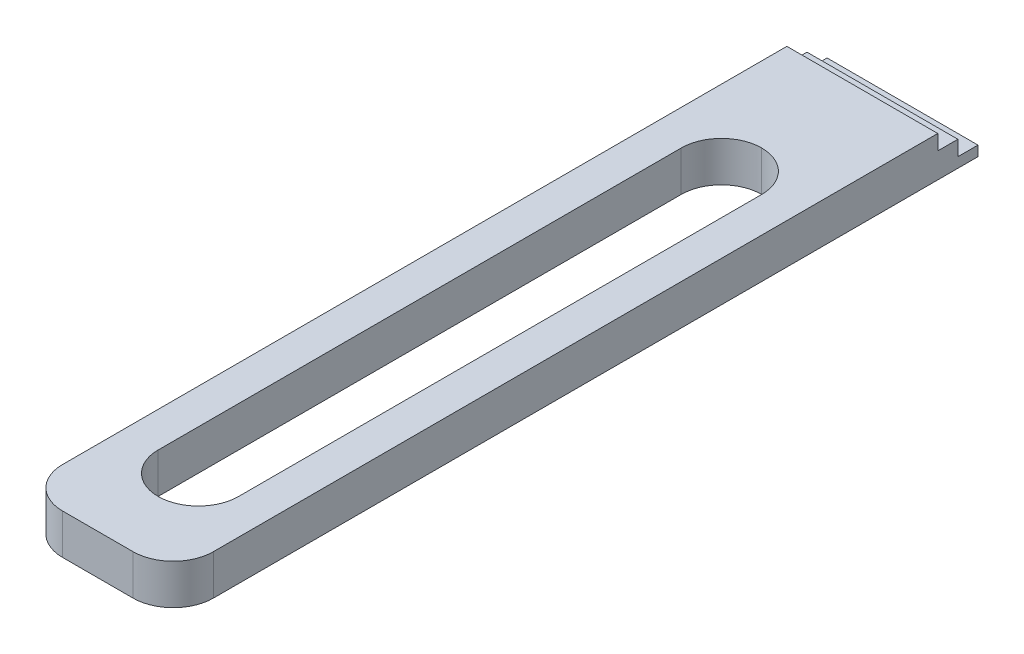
ISO-10303-21;
HEADER;
FILE_DESCRIPTION(('STEP AP214'),'2;1');
FILE_NAME('part.step','',(''),(''),'','','');
FILE_SCHEMA(('AUTOMOTIVE_DESIGN { 1 0 10303 214 1 1 1 1 }'));
ENDSEC;
DATA;
#1=APPLICATION_CONTEXT('core data for automotive mechanical design processes');
#2=APPLICATION_PROTOCOL_DEFINITION('international standard','automotive_design',2000,#1);
#3=PRODUCT_CONTEXT('',#1,'mechanical');
#4=PRODUCT('Part','Part','',(#3));
#5=PRODUCT_RELATED_PRODUCT_CATEGORY('part','',(#4));
#6=PRODUCT_DEFINITION_FORMATION('','',#4);
#7=PRODUCT_DEFINITION_CONTEXT('part definition',#1,'design');
#8=PRODUCT_DEFINITION('design','',#6,#7);
#9=PRODUCT_DEFINITION_SHAPE('','',#8);
#10=(LENGTH_UNIT() NAMED_UNIT(*) SI_UNIT(.MILLI.,.METRE.));
#11=(NAMED_UNIT(*) PLANE_ANGLE_UNIT() SI_UNIT($,.RADIAN.));
#12=(NAMED_UNIT(*) SI_UNIT($,.STERADIAN.) SOLID_ANGLE_UNIT());
#13=UNCERTAINTY_MEASURE_WITH_UNIT(LENGTH_MEASURE(1.E-05),#10,'distance_accuracy_value','');
#14=(GEOMETRIC_REPRESENTATION_CONTEXT(3) GLOBAL_UNCERTAINTY_ASSIGNED_CONTEXT((#13)) GLOBAL_UNIT_ASSIGNED_CONTEXT((#10,
#11,#12)) REPRESENTATION_CONTEXT('',''));
#15=CARTESIAN_POINT('',(0.,0.,0.));
#16=DIRECTION('',(0.,0.,1.));
#17=DIRECTION('',(1.,0.,0.));
#18=AXIS2_PLACEMENT_3D('',#15,#16,#17);
#19=CARTESIAN_POINT('',(-15.4687168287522,4.,-48.7982833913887));
#20=DIRECTION('',(0.,0.,1.));
#21=DIRECTION('',(1.,0.,0.));
#22=AXIS2_PLACEMENT_3D('',#19,#20,#21);
#23=PLANE('',#22);
#24=DIRECTION('',(-1.,0.,0.));
#25=VECTOR('',#24,1.);
#26=CARTESIAN_POINT('',(-15.4687168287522,1.,-48.7982833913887));
#27=LINE('',#26,#25);
#28=CARTESIAN_POINT('',(-0.468716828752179,1.,-48.7982833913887));
#29=VERTEX_POINT('',#28);
#30=CARTESIAN_POINT('',(-15.4687168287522,1.,-48.7982833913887));
#31=VERTEX_POINT('',#30);
#32=EDGE_CURVE('E171',#29,#31,#27,.T.);
#33=ORIENTED_EDGE('',*,*,#32,.F.);
#34=DIRECTION('',(0.,-1.,0.));
#35=VECTOR('',#34,1.);
#36=CARTESIAN_POINT('',(-0.468716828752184,4.,-48.7982833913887));
#37=LINE('',#36,#35);
#38=CARTESIAN_POINT('',(-0.468716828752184,0.,-48.7982833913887));
#39=VERTEX_POINT('',#38);
#40=EDGE_CURVE('E577',#29,#39,#37,.T.);
#41=ORIENTED_EDGE('',*,*,#40,.T.);
#42=DIRECTION('',(-1.,0.,0.));
#43=VECTOR('',#42,1.);
#44=CARTESIAN_POINT('',(-15.4687168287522,0.,-48.7982833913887));
#45=LINE('',#44,#43);
#46=CARTESIAN_POINT('',(-15.4687168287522,0.,-48.7982833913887));
#47=VERTEX_POINT('',#46);
#48=EDGE_CURVE('E572',#39,#47,#45,.T.);
#49=ORIENTED_EDGE('',*,*,#48,.T.);
#50=DIRECTION('',(0.,-1.,0.));
#51=VECTOR('',#50,1.);
#52=CARTESIAN_POINT('',(-15.4687168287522,4.,-48.7982833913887));
#53=LINE('',#52,#51);
#54=EDGE_CURVE('E557',#31,#47,#53,.T.);
#55=ORIENTED_EDGE('',*,*,#54,.F.);
#56=EDGE_LOOP('',(#33,#41,#49,#55));
#57=FACE_BOUND('',#56,.T.);
#58=ADVANCED_FACE('F44',(#57),#23,.F.);
#59=CARTESIAN_POINT('',(0.,4.,0.));
#60=DIRECTION('',(0.,1.,0.));
#61=DIRECTION('',(0.,0.,1.));
#62=AXIS2_PLACEMENT_3D('',#59,#60,#61);
#63=PLANE('',#62);
#64=DIRECTION('',(1.,0.,0.));
#65=VECTOR('',#64,1.);
#66=CARTESIAN_POINT('',(-15.4687168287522,4.,-44.7982833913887));
#67=LINE('',#66,#65);
#68=CARTESIAN_POINT('',(-15.4687168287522,4.,-44.7982833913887));
#69=VERTEX_POINT('',#68);
#70=CARTESIAN_POINT('',(-0.468716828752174,4.,-44.7982833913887));
#71=VERTEX_POINT('',#70);
#72=EDGE_CURVE('E181',#69,#71,#67,.T.);
#73=ORIENTED_EDGE('',*,*,#72,.F.);
#74=DIRECTION('',(0.,0.,1.));
#75=VECTOR('',#74,1.);
#76=CARTESIAN_POINT('',(-15.4687168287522,4.,-48.7982833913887));
#77=LINE('',#76,#75);
#78=CARTESIAN_POINT('',(-15.4687168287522,4.,27.2017166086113));
#79=VERTEX_POINT('',#78);
#80=EDGE_CURVE('E575',#69,#79,#77,.T.);
#81=ORIENTED_EDGE('',*,*,#80,.T.);
#82=CARTESIAN_POINT('',(-11.4687168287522,4.,27.2017166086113));
#83=DIRECTION('',(0.,1.,0.));
#84=DIRECTION('',(0.,0.,1.));
#85=AXIS2_PLACEMENT_3D('',#82,#83,#84);
#86=CIRCLE('',#85,4.);
#87=CARTESIAN_POINT('',(-11.4687168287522,4.,31.2017166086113));
#88=VERTEX_POINT('',#87);
#89=EDGE_CURVE('E591',#79,#88,#86,.T.);
#90=ORIENTED_EDGE('',*,*,#89,.T.);
#91=DIRECTION('',(1.,0.,0.));
#92=VECTOR('',#91,1.);
#93=CARTESIAN_POINT('',(-15.4687168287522,4.,31.2017166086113));
#94=LINE('',#93,#92);
#95=CARTESIAN_POINT('',(-4.46871682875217,4.,31.2017166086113));
#96=VERTEX_POINT('',#95);
#97=EDGE_CURVE('E558',#88,#96,#94,.T.);
#98=ORIENTED_EDGE('',*,*,#97,.T.);
#99=CARTESIAN_POINT('',(-4.46871682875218,4.,27.2017166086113));
#100=DIRECTION('',(0.,1.,0.));
#101=DIRECTION('',(0.,0.,1.));
#102=AXIS2_PLACEMENT_3D('',#99,#100,#101);
#103=CIRCLE('',#102,4.);
#104=CARTESIAN_POINT('',(-0.468716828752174,4.,27.2017166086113));
#105=VERTEX_POINT('',#104);
#106=EDGE_CURVE('E593',#96,#105,#103,.T.);
#107=ORIENTED_EDGE('',*,*,#106,.T.);
#108=DIRECTION('',(0.,0.,-1.));
#109=VECTOR('',#108,1.);
#110=CARTESIAN_POINT('',(-0.468716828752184,4.,-48.7982833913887));
#111=LINE('',#110,#109);
#112=EDGE_CURVE('E552',#105,#71,#111,.T.);
#113=ORIENTED_EDGE('',*,*,#112,.T.);
#114=EDGE_LOOP('',(#73,#81,#90,#98,#107,#113));
#115=FACE_BOUND('',#114,.T.);
#116=CARTESIAN_POINT('',(-7.96871682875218,4.,21.2017166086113));
#117=DIRECTION('',(0.,1.,0.));
#118=DIRECTION('',(0.,0.,1.));
#119=AXIS2_PLACEMENT_3D('',#116,#117,#118);
#120=CIRCLE('',#119,4.);
#121=CARTESIAN_POINT('',(-3.96871682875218,4.,21.2017166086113));
#122=VERTEX_POINT('',#121);
#123=CARTESIAN_POINT('',(-7.96871682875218,4.,25.2017166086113));
#124=VERTEX_POINT('',#123);
#125=EDGE_CURVE('E626',#122,#124,#120,.F.);
#126=ORIENTED_EDGE('',*,*,#125,.T.);
#127=CARTESIAN_POINT('',(-7.96871682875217,4.,21.2017166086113));
#128=DIRECTION('',(0.,1.,0.));
#129=DIRECTION('',(0.,0.,1.));
#130=AXIS2_PLACEMENT_3D('',#127,#128,#129);
#131=CIRCLE('',#130,4.);
#132=CARTESIAN_POINT('',(-11.9687168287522,4.,21.2017166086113));
#133=VERTEX_POINT('',#132);
#134=EDGE_CURVE('E622',#124,#133,#131,.F.);
#135=ORIENTED_EDGE('',*,*,#134,.T.);
#136=DIRECTION('',(0.,0.,1.));
#137=VECTOR('',#136,1.);
#138=CARTESIAN_POINT('',(-11.9687168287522,4.,-34.7982833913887));
#139=LINE('',#138,#137);
#140=CARTESIAN_POINT('',(-11.9687168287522,4.,-30.7982833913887));
#141=VERTEX_POINT('',#140);
#142=EDGE_CURVE('E539',#141,#133,#139,.T.);
#143=ORIENTED_EDGE('',*,*,#142,.F.);
#144=CARTESIAN_POINT('',(-7.96871682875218,4.,-30.7982833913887));
#145=DIRECTION('',(0.,1.,0.));
#146=DIRECTION('',(0.,0.,1.));
#147=AXIS2_PLACEMENT_3D('',#144,#145,#146);
#148=CIRCLE('',#147,4.);
#149=CARTESIAN_POINT('',(-7.96871682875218,4.,-34.7982833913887));
#150=VERTEX_POINT('',#149);
#151=EDGE_CURVE('E12',#141,#150,#148,.F.);
#152=ORIENTED_EDGE('',*,*,#151,.T.);
#153=CARTESIAN_POINT('',(-7.96871682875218,4.,-30.7982833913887));
#154=DIRECTION('',(0.,1.,0.));
#155=DIRECTION('',(0.,0.,1.));
#156=AXIS2_PLACEMENT_3D('',#153,#154,#155);
#157=CIRCLE('',#156,4.);
#158=CARTESIAN_POINT('',(-3.96871682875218,4.,-30.7982833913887));
#159=VERTEX_POINT('',#158);
#160=EDGE_CURVE('E617',#150,#159,#157,.F.);
#161=ORIENTED_EDGE('',*,*,#160,.T.);
#162=DIRECTION('',(0.,0.,-1.));
#163=VECTOR('',#162,1.);
#164=CARTESIAN_POINT('',(-3.96871682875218,4.,-34.7982833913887));
#165=LINE('',#164,#163);
#166=EDGE_CURVE('E543',#122,#159,#165,.T.);
#167=ORIENTED_EDGE('',*,*,#166,.F.);
#168=EDGE_LOOP('',(#126,#135,#143,#152,#161,#167));
#169=FACE_BOUND('',#168,.T.);
#170=ADVANCED_FACE('F650',(#115,#169),#63,.T.);
#171=CARTESIAN_POINT('',(0.,0.,0.));
#172=DIRECTION('',(0.,1.,0.));
#173=DIRECTION('',(0.,0.,1.));
#174=AXIS2_PLACEMENT_3D('',#171,#172,#173);
#175=PLANE('',#174);
#176=DIRECTION('',(0.,0.,-1.));
#177=VECTOR('',#176,1.);
#178=CARTESIAN_POINT('',(-0.468716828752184,0.,-48.7982833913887));
#179=LINE('',#178,#177);
#180=CARTESIAN_POINT('',(-0.468716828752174,0.,27.2017166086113));
#181=VERTEX_POINT('',#180);
#182=EDGE_CURVE('E568',#181,#39,#179,.T.);
#183=ORIENTED_EDGE('',*,*,#182,.F.);
#184=CARTESIAN_POINT('',(-4.46871682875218,0.,27.2017166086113));
#185=DIRECTION('',(0.,1.,0.));
#186=DIRECTION('',(0.,0.,1.));
#187=AXIS2_PLACEMENT_3D('',#184,#185,#186);
#188=CIRCLE('',#187,4.);
#189=CARTESIAN_POINT('',(-4.46871682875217,0.,31.2017166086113));
#190=VERTEX_POINT('',#189);
#191=EDGE_CURVE('E584',#181,#190,#188,.F.);
#192=ORIENTED_EDGE('',*,*,#191,.T.);
#193=DIRECTION('',(1.,0.,0.));
#194=VECTOR('',#193,1.);
#195=CARTESIAN_POINT('',(-15.4687168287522,0.,31.2017166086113));
#196=LINE('',#195,#194);
#197=CARTESIAN_POINT('',(-11.4687168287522,0.,31.2017166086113));
#198=VERTEX_POINT('',#197);
#199=EDGE_CURVE('E565',#198,#190,#196,.T.);
#200=ORIENTED_EDGE('',*,*,#199,.F.);
#201=CARTESIAN_POINT('',(-11.4687168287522,0.,27.2017166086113));
#202=DIRECTION('',(0.,1.,0.));
#203=DIRECTION('',(0.,0.,1.));
#204=AXIS2_PLACEMENT_3D('',#201,#202,#203);
#205=CIRCLE('',#204,4.);
#206=CARTESIAN_POINT('',(-15.4687168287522,0.,27.2017166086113));
#207=VERTEX_POINT('',#206);
#208=EDGE_CURVE('E582',#198,#207,#205,.F.);
#209=ORIENTED_EDGE('',*,*,#208,.T.);
#210=DIRECTION('',(0.,0.,1.));
#211=VECTOR('',#210,1.);
#212=CARTESIAN_POINT('',(-15.4687168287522,0.,-48.7982833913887));
#213=LINE('',#212,#211);
#214=EDGE_CURVE('E561',#47,#207,#213,.T.);
#215=ORIENTED_EDGE('',*,*,#214,.F.);
#216=ORIENTED_EDGE('',*,*,#48,.F.);
#217=EDGE_LOOP('',(#183,#192,#200,#209,#215,#216));
#218=FACE_BOUND('',#217,.T.);
#219=CARTESIAN_POINT('',(-7.96871682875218,0.,-30.7982833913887));
#220=DIRECTION('',(0.,1.,0.));
#221=DIRECTION('',(0.,0.,1.));
#222=AXIS2_PLACEMENT_3D('',#219,#220,#221);
#223=CIRCLE('',#222,4.);
#224=CARTESIAN_POINT('',(-3.96871682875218,0.,-30.7982833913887));
#225=VERTEX_POINT('',#224);
#226=CARTESIAN_POINT('',(-7.96871682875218,0.,-34.7982833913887));
#227=VERTEX_POINT('',#226);
#228=EDGE_CURVE('E619',#225,#227,#223,.T.);
#229=ORIENTED_EDGE('',*,*,#228,.T.);
#230=CARTESIAN_POINT('',(-7.96871682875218,0.,-30.7982833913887));
#231=DIRECTION('',(0.,1.,0.));
#232=DIRECTION('',(0.,0.,1.));
#233=AXIS2_PLACEMENT_3D('',#230,#231,#232);
#234=CIRCLE('',#233,4.);
#235=CARTESIAN_POINT('',(-11.9687168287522,0.,-30.7982833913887));
#236=VERTEX_POINT('',#235);
#237=EDGE_CURVE('E53',#227,#236,#234,.T.);
#238=ORIENTED_EDGE('',*,*,#237,.T.);
#239=DIRECTION('',(0.,0.,1.));
#240=VECTOR('',#239,1.);
#241=CARTESIAN_POINT('',(-11.9687168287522,0.,-34.7982833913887));
#242=LINE('',#241,#240);
#243=CARTESIAN_POINT('',(-11.9687168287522,0.,21.2017166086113));
#244=VERTEX_POINT('',#243);
#245=EDGE_CURVE('E604',#236,#244,#242,.T.);
#246=ORIENTED_EDGE('',*,*,#245,.T.);
#247=CARTESIAN_POINT('',(-7.96871682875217,0.,21.2017166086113));
#248=DIRECTION('',(0.,1.,0.));
#249=DIRECTION('',(0.,0.,1.));
#250=AXIS2_PLACEMENT_3D('',#247,#248,#249);
#251=CIRCLE('',#250,4.);
#252=CARTESIAN_POINT('',(-7.96871682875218,0.,25.2017166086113));
#253=VERTEX_POINT('',#252);
#254=EDGE_CURVE('E624',#244,#253,#251,.T.);
#255=ORIENTED_EDGE('',*,*,#254,.T.);
#256=CARTESIAN_POINT('',(-7.96871682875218,0.,21.2017166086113));
#257=DIRECTION('',(0.,1.,0.));
#258=DIRECTION('',(0.,0.,1.));
#259=AXIS2_PLACEMENT_3D('',#256,#257,#258);
#260=CIRCLE('',#259,4.);
#261=CARTESIAN_POINT('',(-3.96871682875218,0.,21.2017166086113));
#262=VERTEX_POINT('',#261);
#263=EDGE_CURVE('E628',#253,#262,#260,.T.);
#264=ORIENTED_EDGE('',*,*,#263,.T.);
#265=DIRECTION('',(0.,0.,-1.));
#266=VECTOR('',#265,1.);
#267=CARTESIAN_POINT('',(-3.96871682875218,0.,-34.7982833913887));
#268=LINE('',#267,#266);
#269=EDGE_CURVE('E544',#262,#225,#268,.T.);
#270=ORIENTED_EDGE('',*,*,#269,.T.);
#271=EDGE_LOOP('',(#229,#238,#246,#255,#264,#270));
#272=FACE_BOUND('',#271,.T.);
#273=ADVANCED_FACE('F659',(#218,#272),#175,.F.);
#274=CARTESIAN_POINT('',(-15.4687168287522,4.,-48.7982833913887));
#275=DIRECTION('',(1.,0.,0.));
#276=DIRECTION('',(0.,0.,-1.));
#277=AXIS2_PLACEMENT_3D('',#274,#275,#276);
#278=PLANE('',#277);
#279=DIRECTION('',(0.,0.,1.));
#280=VECTOR('',#279,1.);
#281=CARTESIAN_POINT('',(-15.4687168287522,2.5,-48.7982833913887));
#282=LINE('',#281,#280);
#283=CARTESIAN_POINT('',(-15.4687168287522,2.5,-46.7982833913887));
#284=VERTEX_POINT('',#283);
#285=CARTESIAN_POINT('',(-15.4687168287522,2.5,-44.7982833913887));
#286=VERTEX_POINT('',#285);
#287=EDGE_CURVE('E179',#284,#286,#282,.T.);
#288=ORIENTED_EDGE('',*,*,#287,.F.);
#289=DIRECTION('',(0.,1.,0.));
#290=VECTOR('',#289,1.);
#291=CARTESIAN_POINT('',(-15.4687168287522,1.,-46.7982833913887));
#292=LINE('',#291,#290);
#293=CARTESIAN_POINT('',(-15.4687168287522,1.,-46.7982833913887));
#294=VERTEX_POINT('',#293);
#295=EDGE_CURVE('E61',#294,#284,#292,.T.);
#296=ORIENTED_EDGE('',*,*,#295,.F.);
#297=DIRECTION('',(0.,0.,1.));
#298=VECTOR('',#297,1.);
#299=CARTESIAN_POINT('',(-15.4687168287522,1.,-48.7982833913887));
#300=LINE('',#299,#298);
#301=EDGE_CURVE('E166',#31,#294,#300,.T.);
#302=ORIENTED_EDGE('',*,*,#301,.F.);
#303=ORIENTED_EDGE('',*,*,#54,.T.);
#304=ORIENTED_EDGE('',*,*,#214,.T.);
#305=DIRECTION('',(0.,-1.,0.));
#306=VECTOR('',#305,1.);
#307=CARTESIAN_POINT('',(-15.4687168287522,4.,27.2017166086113));
#308=LINE('',#307,#306);
#309=EDGE_CURVE('E639',#207,#79,#308,.F.);
#310=ORIENTED_EDGE('',*,*,#309,.T.);
#311=ORIENTED_EDGE('',*,*,#80,.F.);
#312=DIRECTION('',(0.,1.,0.));
#313=VECTOR('',#312,1.);
#314=CARTESIAN_POINT('',(-15.4687168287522,2.5,-44.7982833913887));
#315=LINE('',#314,#313);
#316=EDGE_CURVE('E531',#286,#69,#315,.T.);
#317=ORIENTED_EDGE('',*,*,#316,.F.);
#318=EDGE_LOOP('',(#288,#296,#302,#303,#304,#310,#311,#317));
#319=FACE_BOUND('',#318,.T.);
#320=ADVANCED_FACE('F177',(#319),#278,.F.);
#321=CARTESIAN_POINT('',(-15.4687168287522,4.,31.2017166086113));
#322=DIRECTION('',(0.,0.,-1.));
#323=DIRECTION('',(-1.,0.,0.));
#324=AXIS2_PLACEMENT_3D('',#321,#322,#323);
#325=PLANE('',#324);
#326=ORIENTED_EDGE('',*,*,#199,.T.);
#327=DIRECTION('',(0.,-1.,0.));
#328=VECTOR('',#327,1.);
#329=CARTESIAN_POINT('',(-4.46871682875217,4.,31.2017166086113));
#330=LINE('',#329,#328);
#331=EDGE_CURVE('E589',#190,#96,#330,.F.);
#332=ORIENTED_EDGE('',*,*,#331,.T.);
#333=ORIENTED_EDGE('',*,*,#97,.F.);
#334=DIRECTION('',(0.,-1.,0.));
#335=VECTOR('',#334,1.);
#336=CARTESIAN_POINT('',(-11.4687168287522,4.,31.2017166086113));
#337=LINE('',#336,#335);
#338=EDGE_CURVE('E586',#88,#198,#337,.T.);
#339=ORIENTED_EDGE('',*,*,#338,.T.);
#340=EDGE_LOOP('',(#326,#332,#333,#339));
#341=FACE_BOUND('',#340,.T.);
#342=ADVANCED_FACE('F662',(#341),#325,.F.);
#343=CARTESIAN_POINT('',(-0.468716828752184,4.,-48.7982833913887));
#344=DIRECTION('',(-1.,0.,0.));
#345=DIRECTION('',(0.,0.,1.));
#346=AXIS2_PLACEMENT_3D('',#343,#344,#345);
#347=PLANE('',#346);
#348=DIRECTION('',(0.,0.,-1.));
#349=VECTOR('',#348,1.);
#350=CARTESIAN_POINT('',(-0.468716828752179,1.,-48.7982833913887));
#351=LINE('',#350,#349);
#352=CARTESIAN_POINT('',(-0.468716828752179,1.,-46.7982833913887));
#353=VERTEX_POINT('',#352);
#354=EDGE_CURVE('E165',#353,#29,#351,.T.);
#355=ORIENTED_EDGE('',*,*,#354,.F.);
#356=DIRECTION('',(0.,1.,0.));
#357=VECTOR('',#356,1.);
#358=CARTESIAN_POINT('',(-0.468716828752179,1.,-46.7982833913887));
#359=LINE('',#358,#357);
#360=CARTESIAN_POINT('',(-0.468716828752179,2.5,-46.7982833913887));
#361=VERTEX_POINT('',#360);
#362=EDGE_CURVE('E161',#353,#361,#359,.T.);
#363=ORIENTED_EDGE('',*,*,#362,.T.);
#364=DIRECTION('',(0.,0.,-1.));
#365=VECTOR('',#364,1.);
#366=CARTESIAN_POINT('',(-0.468716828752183,2.5,-48.7982833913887));
#367=LINE('',#366,#365);
#368=CARTESIAN_POINT('',(-0.468716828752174,2.5,-44.7982833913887));
#369=VERTEX_POINT('',#368);
#370=EDGE_CURVE('E526',#369,#361,#367,.T.);
#371=ORIENTED_EDGE('',*,*,#370,.F.);
#372=DIRECTION('',(0.,1.,0.));
#373=VECTOR('',#372,1.);
#374=CARTESIAN_POINT('',(-0.468716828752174,2.5,-44.7982833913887));
#375=LINE('',#374,#373);
#376=EDGE_CURVE('E532',#369,#71,#375,.T.);
#377=ORIENTED_EDGE('',*,*,#376,.T.);
#378=ORIENTED_EDGE('',*,*,#112,.F.);
#379=DIRECTION('',(0.,-1.,0.));
#380=VECTOR('',#379,1.);
#381=CARTESIAN_POINT('',(-0.468716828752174,4.,27.2017166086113));
#382=LINE('',#381,#380);
#383=EDGE_CURVE('E579',#105,#181,#382,.T.);
#384=ORIENTED_EDGE('',*,*,#383,.T.);
#385=ORIENTED_EDGE('',*,*,#182,.T.);
#386=ORIENTED_EDGE('',*,*,#40,.F.);
#387=EDGE_LOOP('',(#355,#363,#371,#377,#378,#384,#385,#386));
#388=FACE_BOUND('',#387,.T.);
#389=ADVANCED_FACE('F524',(#388),#347,.F.);
#390=CARTESIAN_POINT('',(-11.9687168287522,4.,-34.7982833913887));
#391=DIRECTION('',(1.,0.,0.));
#392=DIRECTION('',(0.,0.,-1.));
#393=AXIS2_PLACEMENT_3D('',#390,#391,#392);
#394=PLANE('',#393);
#395=ORIENTED_EDGE('',*,*,#142,.T.);
#396=DIRECTION('',(0.,-1.,0.));
#397=VECTOR('',#396,1.);
#398=CARTESIAN_POINT('',(-11.9687168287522,0.,21.2017166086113));
#399=LINE('',#398,#397);
#400=EDGE_CURVE('E630',#133,#244,#399,.T.);
#401=ORIENTED_EDGE('',*,*,#400,.T.);
#402=ORIENTED_EDGE('',*,*,#245,.F.);
#403=DIRECTION('',(0.,-1.,0.));
#404=VECTOR('',#403,1.);
#405=CARTESIAN_POINT('',(-11.9687168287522,4.,-30.7982833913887));
#406=LINE('',#405,#404);
#407=EDGE_CURVE('E632',#236,#141,#406,.F.);
#408=ORIENTED_EDGE('',*,*,#407,.T.);
#409=EDGE_LOOP('',(#395,#401,#402,#408));
#410=FACE_BOUND('',#409,.T.);
#411=ADVANCED_FACE('F678',(#410),#394,.T.);
#412=CARTESIAN_POINT('',(-3.96871682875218,4.,-34.7982833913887));
#413=DIRECTION('',(-1.,0.,0.));
#414=DIRECTION('',(0.,0.,1.));
#415=AXIS2_PLACEMENT_3D('',#412,#413,#414);
#416=PLANE('',#415);
#417=ORIENTED_EDGE('',*,*,#269,.F.);
#418=DIRECTION('',(0.,-1.,0.));
#419=VECTOR('',#418,1.);
#420=CARTESIAN_POINT('',(-3.96871682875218,4.,21.2017166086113));
#421=LINE('',#420,#419);
#422=EDGE_CURVE('E634',#262,#122,#421,.F.);
#423=ORIENTED_EDGE('',*,*,#422,.T.);
#424=ORIENTED_EDGE('',*,*,#166,.T.);
#425=DIRECTION('',(0.,-1.,0.));
#426=VECTOR('',#425,1.);
#427=CARTESIAN_POINT('',(-3.96871682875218,0.,-30.7982833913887));
#428=LINE('',#427,#426);
#429=EDGE_CURVE('E637',#159,#225,#428,.T.);
#430=ORIENTED_EDGE('',*,*,#429,.T.);
#431=EDGE_LOOP('',(#417,#423,#424,#430));
#432=FACE_BOUND('',#431,.T.);
#433=ADVANCED_FACE('F685',(#432),#416,.T.);
#434=CARTESIAN_POINT('',(-4.46871682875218,4.,27.2017166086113));
#435=DIRECTION('',(0.,-1.,0.));
#436=DIRECTION('',(0.,0.,-1.));
#437=AXIS2_PLACEMENT_3D('',#434,#435,#436);
#438=CYLINDRICAL_SURFACE('',#437,4.);
#439=ORIENTED_EDGE('',*,*,#106,.F.);
#440=ORIENTED_EDGE('',*,*,#331,.F.);
#441=ORIENTED_EDGE('',*,*,#191,.F.);
#442=ORIENTED_EDGE('',*,*,#383,.F.);
#443=EDGE_LOOP('',(#439,#440,#441,#442));
#444=FACE_BOUND('',#443,.T.);
#445=ADVANCED_FACE('F656',(#444),#438,.T.);
#446=CARTESIAN_POINT('',(-11.4687168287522,4.,27.2017166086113));
#447=DIRECTION('',(0.,-1.,0.));
#448=DIRECTION('',(0.,0.,-1.));
#449=AXIS2_PLACEMENT_3D('',#446,#447,#448);
#450=CYLINDRICAL_SURFACE('',#449,4.);
#451=ORIENTED_EDGE('',*,*,#89,.F.);
#452=ORIENTED_EDGE('',*,*,#309,.F.);
#453=ORIENTED_EDGE('',*,*,#208,.F.);
#454=ORIENTED_EDGE('',*,*,#338,.F.);
#455=EDGE_LOOP('',(#451,#452,#453,#454));
#456=FACE_BOUND('',#455,.T.);
#457=ADVANCED_FACE('F665',(#456),#450,.T.);
#458=CARTESIAN_POINT('',(-7.96871682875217,4.,21.2017166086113));
#459=DIRECTION('',(0.,1.,0.));
#460=DIRECTION('',(0.,0.,1.));
#461=AXIS2_PLACEMENT_3D('',#458,#459,#460);
#462=CYLINDRICAL_SURFACE('',#461,4.);
#463=ORIENTED_EDGE('',*,*,#400,.F.);
#464=ORIENTED_EDGE('',*,*,#134,.F.);
#465=DIRECTION('',(0.,-1.,0.));
#466=VECTOR('',#465,1.);
#467=CARTESIAN_POINT('',(-7.96871682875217,4.,25.2017166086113));
#468=LINE('',#467,#466);
#469=EDGE_CURVE('E606',#253,#124,#468,.F.);
#470=ORIENTED_EDGE('',*,*,#469,.F.);
#471=ORIENTED_EDGE('',*,*,#254,.F.);
#472=EDGE_LOOP('',(#463,#464,#470,#471));
#473=FACE_BOUND('',#472,.T.);
#474=ADVANCED_FACE('F688',(#473),#462,.F.);
#475=CARTESIAN_POINT('',(-7.96871682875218,4.,21.2017166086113));
#476=DIRECTION('',(0.,1.,0.));
#477=DIRECTION('',(0.,0.,1.));
#478=AXIS2_PLACEMENT_3D('',#475,#476,#477);
#479=CYLINDRICAL_SURFACE('',#478,4.);
#480=ORIENTED_EDGE('',*,*,#125,.F.);
#481=ORIENTED_EDGE('',*,*,#422,.F.);
#482=ORIENTED_EDGE('',*,*,#263,.F.);
#483=ORIENTED_EDGE('',*,*,#469,.T.);
#484=EDGE_LOOP('',(#480,#481,#482,#483));
#485=FACE_BOUND('',#484,.T.);
#486=ADVANCED_FACE('F689',(#485),#479,.F.);
#487=CARTESIAN_POINT('',(-7.96871682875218,4.,-30.7982833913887));
#488=DIRECTION('',(0.,1.,0.));
#489=DIRECTION('',(0.,0.,1.));
#490=AXIS2_PLACEMENT_3D('',#487,#488,#489);
#491=CYLINDRICAL_SURFACE('',#490,4.);
#492=DIRECTION('',(0.,-1.,0.));
#493=VECTOR('',#492,1.);
#494=CARTESIAN_POINT('',(-7.96871682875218,0.,-34.7982833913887));
#495=LINE('',#494,#493);
#496=EDGE_CURVE('E48',#150,#227,#495,.T.);
#497=ORIENTED_EDGE('',*,*,#496,.F.);
#498=ORIENTED_EDGE('',*,*,#151,.F.);
#499=ORIENTED_EDGE('',*,*,#407,.F.);
#500=ORIENTED_EDGE('',*,*,#237,.F.);
#501=EDGE_LOOP('',(#497,#498,#499,#500));
#502=FACE_BOUND('',#501,.T.);
#503=ADVANCED_FACE('F46',(#502),#491,.F.);
#504=CARTESIAN_POINT('',(-7.96871682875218,4.,-30.7982833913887));
#505=DIRECTION('',(0.,1.,0.));
#506=DIRECTION('',(0.,0.,1.));
#507=AXIS2_PLACEMENT_3D('',#504,#505,#506);
#508=CYLINDRICAL_SURFACE('',#507,4.);
#509=ORIENTED_EDGE('',*,*,#160,.F.);
#510=ORIENTED_EDGE('',*,*,#496,.T.);
#511=ORIENTED_EDGE('',*,*,#228,.F.);
#512=ORIENTED_EDGE('',*,*,#429,.F.);
#513=EDGE_LOOP('',(#509,#510,#511,#512));
#514=FACE_BOUND('',#513,.T.);
#515=ADVANCED_FACE('F694',(#514),#508,.F.);
#516=CARTESIAN_POINT('',(-15.4687168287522,2.5,-44.7982833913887));
#517=DIRECTION('',(0.,0.,1.));
#518=DIRECTION('',(1.,0.,0.));
#519=AXIS2_PLACEMENT_3D('',#516,#517,#518);
#520=PLANE('',#519);
#521=ORIENTED_EDGE('',*,*,#72,.T.);
#522=ORIENTED_EDGE('',*,*,#376,.F.);
#523=DIRECTION('',(1.,0.,0.));
#524=VECTOR('',#523,1.);
#525=CARTESIAN_POINT('',(-15.4687168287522,2.5,-44.7982833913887));
#526=LINE('',#525,#524);
#527=EDGE_CURVE('E188',#286,#369,#526,.T.);
#528=ORIENTED_EDGE('',*,*,#527,.F.);
#529=ORIENTED_EDGE('',*,*,#316,.T.);
#530=EDGE_LOOP('',(#521,#522,#528,#529));
#531=FACE_BOUND('',#530,.T.);
#532=ADVANCED_FACE('F696',(#531),#520,.F.);
#533=CARTESIAN_POINT('',(0.,2.5,0.));
#534=DIRECTION('',(0.,1.,0.));
#535=DIRECTION('',(0.,0.,1.));
#536=AXIS2_PLACEMENT_3D('',#533,#534,#535);
#537=PLANE('',#536);
#538=DIRECTION('',(1.,0.,0.));
#539=VECTOR('',#538,1.);
#540=CARTESIAN_POINT('',(-15.4687168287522,2.5,-46.7982833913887));
#541=LINE('',#540,#539);
#542=EDGE_CURVE('E174',#284,#361,#541,.T.);
#543=ORIENTED_EDGE('',*,*,#542,.F.);
#544=ORIENTED_EDGE('',*,*,#287,.T.);
#545=ORIENTED_EDGE('',*,*,#527,.T.);
#546=ORIENTED_EDGE('',*,*,#370,.T.);
#547=EDGE_LOOP('',(#543,#544,#545,#546));
#548=FACE_BOUND('',#547,.T.);
#549=ADVANCED_FACE('F529',(#548),#537,.T.);
#550=CARTESIAN_POINT('',(-15.4687168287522,1.,-46.7982833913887));
#551=DIRECTION('',(0.,0.,1.));
#552=DIRECTION('',(1.,0.,0.));
#553=AXIS2_PLACEMENT_3D('',#550,#551,#552);
#554=PLANE('',#553);
#555=ORIENTED_EDGE('',*,*,#542,.T.);
#556=ORIENTED_EDGE('',*,*,#362,.F.);
#557=DIRECTION('',(1.,0.,0.));
#558=VECTOR('',#557,1.);
#559=CARTESIAN_POINT('',(-15.4687168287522,1.,-46.7982833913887));
#560=LINE('',#559,#558);
#561=EDGE_CURVE('E157',#294,#353,#560,.T.);
#562=ORIENTED_EDGE('',*,*,#561,.F.);
#563=ORIENTED_EDGE('',*,*,#295,.T.);
#564=EDGE_LOOP('',(#555,#556,#562,#563));
#565=FACE_BOUND('',#564,.T.);
#566=ADVANCED_FACE('F159',(#565),#554,.F.);
#567=CARTESIAN_POINT('',(0.,1.,0.));
#568=DIRECTION('',(0.,1.,0.));
#569=DIRECTION('',(0.,0.,1.));
#570=AXIS2_PLACEMENT_3D('',#567,#568,#569);
#571=PLANE('',#570);
#572=ORIENTED_EDGE('',*,*,#301,.T.);
#573=ORIENTED_EDGE('',*,*,#561,.T.);
#574=ORIENTED_EDGE('',*,*,#354,.T.);
#575=ORIENTED_EDGE('',*,*,#32,.T.);
#576=EDGE_LOOP('',(#572,#573,#574,#575));
#577=FACE_BOUND('',#576,.T.);
#578=ADVANCED_FACE('F169',(#577),#571,.T.);
#579=CLOSED_SHELL('',(#58,#170,#273,#320,#342,#389,#411,#433,#445,#457,#474,#486,#503,#515,#532,
#549,#566,#578));
#580=MANIFOLD_SOLID_BREP('B2',#579);
#581=ADVANCED_BREP_SHAPE_REPRESENTATION('',(#18,#580),#14);
#582=SHAPE_DEFINITION_REPRESENTATION(#9,#581);
ENDSEC;
END-ISO-10303-21;
